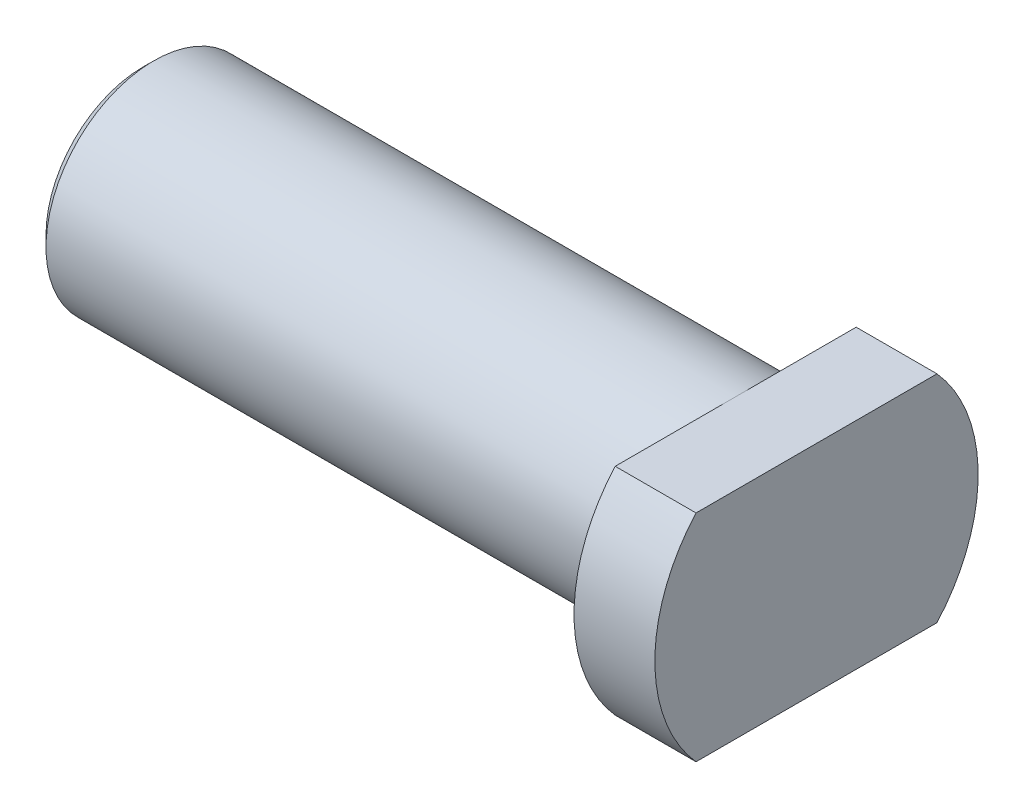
ISO-10303-21;
HEADER;
FILE_DESCRIPTION(('STEP AP214'),'2;1');
FILE_NAME('part.step','',(''),(''),'','','');
FILE_SCHEMA(('AUTOMOTIVE_DESIGN { 1 0 10303 214 1 1 1 1 }'));
ENDSEC;
DATA;
#1=APPLICATION_CONTEXT('core data for automotive mechanical design processes');
#2=APPLICATION_PROTOCOL_DEFINITION('international standard','automotive_design',2000,#1);
#3=PRODUCT_CONTEXT('',#1,'mechanical');
#4=PRODUCT('Part','Part','',(#3));
#5=PRODUCT_RELATED_PRODUCT_CATEGORY('part','',(#4));
#6=PRODUCT_DEFINITION_FORMATION('','',#4);
#7=PRODUCT_DEFINITION_CONTEXT('part definition',#1,'design');
#8=PRODUCT_DEFINITION('design','',#6,#7);
#9=PRODUCT_DEFINITION_SHAPE('','',#8);
#10=(LENGTH_UNIT() NAMED_UNIT(*) SI_UNIT(.MILLI.,.METRE.));
#11=(NAMED_UNIT(*) PLANE_ANGLE_UNIT() SI_UNIT($,.RADIAN.));
#12=(NAMED_UNIT(*) SI_UNIT($,.STERADIAN.) SOLID_ANGLE_UNIT());
#13=UNCERTAINTY_MEASURE_WITH_UNIT(LENGTH_MEASURE(1.E-05),#10,'distance_accuracy_value','');
#14=(GEOMETRIC_REPRESENTATION_CONTEXT(3) GLOBAL_UNCERTAINTY_ASSIGNED_CONTEXT((#13)) GLOBAL_UNIT_ASSIGNED_CONTEXT((#10,
#11,#12)) REPRESENTATION_CONTEXT('',''));
#15=CARTESIAN_POINT('',(0.,0.,0.));
#16=DIRECTION('',(0.,0.,1.));
#17=DIRECTION('',(1.,0.,0.));
#18=AXIS2_PLACEMENT_3D('',#15,#16,#17);
#19=CARTESIAN_POINT('',(-11.625,0.,0.));
#20=DIRECTION('',(1.,0.,0.));
#21=DIRECTION('',(0.,0.,-1.));
#22=AXIS2_PLACEMENT_3D('',#19,#20,#21);
#23=CYLINDRICAL_SURFACE('',#22,3.);
#24=CARTESIAN_POINT('',(0.,0.,0.));
#25=DIRECTION('',(1.,0.,0.));
#26=DIRECTION('',(0.,0.,-1.));
#27=AXIS2_PLACEMENT_3D('',#24,#25,#26);
#28=CIRCLE('',#27,3.);
#29=CARTESIAN_POINT('',(0.,-1.99999999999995,-2.23606797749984));
#30=VERTEX_POINT('',#29);
#31=CARTESIAN_POINT('',(0.,1.99999999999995,-2.23606797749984));
#32=VERTEX_POINT('',#31);
#33=EDGE_CURVE('E100',#30,#32,#28,.T.);
#34=ORIENTED_EDGE('',*,*,#33,.T.);
#35=DIRECTION('',(1.,0.,0.));
#36=VECTOR('',#35,1.);
#37=CARTESIAN_POINT('',(-11.625,1.9999999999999,-2.23606797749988));
#38=LINE('',#37,#36);
#39=CARTESIAN_POINT('',(1.5,1.99999999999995,-2.23606797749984));
#40=VERTEX_POINT('',#39);
#41=EDGE_CURVE('E105',#32,#40,#38,.T.);
#42=ORIENTED_EDGE('',*,*,#41,.T.);
#43=CARTESIAN_POINT('',(1.5,0.,0.));
#44=DIRECTION('',(1.,0.,0.));
#45=DIRECTION('',(0.,0.,-1.));
#46=AXIS2_PLACEMENT_3D('',#43,#44,#45);
#47=CIRCLE('',#46,3.);
#48=CARTESIAN_POINT('',(1.5,-1.99999999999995,-2.23606797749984));
#49=VERTEX_POINT('',#48);
#50=EDGE_CURVE('E19',#49,#40,#47,.T.);
#51=ORIENTED_EDGE('',*,*,#50,.F.);
#52=DIRECTION('',(1.,0.,0.));
#53=VECTOR('',#52,1.);
#54=CARTESIAN_POINT('',(-11.625,-1.9999999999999,-2.23606797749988));
#55=LINE('',#54,#53);
#56=EDGE_CURVE('E56',#49,#30,#55,.F.);
#57=ORIENTED_EDGE('',*,*,#56,.T.);
#58=EDGE_LOOP('',(#34,#42,#51,#57));
#59=FACE_BOUND('',#58,.T.);
#60=ADVANCED_FACE('F16',(#59),#23,.T.);
#61=CARTESIAN_POINT('',(1.5,0.,0.));
#62=DIRECTION('',(1.,0.,0.));
#63=DIRECTION('',(0.,0.,-1.));
#64=AXIS2_PLACEMENT_3D('',#61,#62,#63);
#65=PLANE('',#64);
#66=ORIENTED_EDGE('',*,*,#50,.T.);
#67=DIRECTION('',(0.,0.,-1.));
#68=VECTOR('',#67,1.);
#69=CARTESIAN_POINT('',(1.5,2.,2.2360679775));
#70=LINE('',#69,#68);
#71=CARTESIAN_POINT('',(1.5,1.99999999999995,2.23606797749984));
#72=VERTEX_POINT('',#71);
#73=EDGE_CURVE('E99',#40,#72,#70,.F.);
#74=ORIENTED_EDGE('',*,*,#73,.T.);
#75=CARTESIAN_POINT('',(1.5,0.,0.));
#76=DIRECTION('',(1.,0.,0.));
#77=DIRECTION('',(0.,0.,-1.));
#78=AXIS2_PLACEMENT_3D('',#75,#76,#77);
#79=CIRCLE('',#78,3.);
#80=CARTESIAN_POINT('',(1.5,-2.,2.23606797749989));
#81=VERTEX_POINT('',#80);
#82=EDGE_CURVE('E95',#81,#72,#79,.F.);
#83=ORIENTED_EDGE('',*,*,#82,.F.);
#84=DIRECTION('',(0.,0.,1.));
#85=VECTOR('',#84,1.);
#86=CARTESIAN_POINT('',(1.5,-2.,-2.2360679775));
#87=LINE('',#86,#85);
#88=EDGE_CURVE('E83',#81,#49,#87,.F.);
#89=ORIENTED_EDGE('',*,*,#88,.T.);
#90=EDGE_LOOP('',(#66,#74,#83,#89));
#91=FACE_BOUND('',#90,.T.);
#92=ADVANCED_FACE('F116',(#91),#65,.T.);
#93=CARTESIAN_POINT('',(-11.,0.,0.));
#94=DIRECTION('',(1.,0.,0.));
#95=DIRECTION('',(0.,0.,-1.));
#96=AXIS2_PLACEMENT_3D('',#93,#94,#95);
#97=PLANE('',#96);
#98=CARTESIAN_POINT('',(-11.0000000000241,0.,0.));
#99=DIRECTION('',(1.,0.,0.));
#100=DIRECTION('',(0.,0.,-1.));
#101=AXIS2_PLACEMENT_3D('',#98,#99,#100);
#102=CIRCLE('',#101,1.80000000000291);
#103=CARTESIAN_POINT('',(-11.0000000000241,0.,-1.80000000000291));
#104=VERTEX_POINT('',#103);
#105=EDGE_CURVE('E102',#104,#104,#102,.T.);
#106=ORIENTED_EDGE('',*,*,#105,.F.);
#107=EDGE_LOOP('',(#106));
#108=FACE_BOUND('',#107,.T.);
#109=ADVANCED_FACE('F123',(#108),#97,.F.);
#110=CARTESIAN_POINT('',(0.,0.,0.));
#111=DIRECTION('',(1.,0.,0.));
#112=DIRECTION('',(0.,0.,-1.));
#113=AXIS2_PLACEMENT_3D('',#110,#111,#112);
#114=PLANE('',#113);
#115=DIRECTION('',(0.,0.,1.));
#116=VECTOR('',#115,1.);
#117=CARTESIAN_POINT('',(0.,-2.,-2.2360679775));
#118=LINE('',#117,#116);
#119=CARTESIAN_POINT('',(0.,-2.,0.));
#120=VERTEX_POINT('',#119);
#121=EDGE_CURVE('E34',#30,#120,#118,.T.);
#122=ORIENTED_EDGE('',*,*,#121,.T.);
#123=CARTESIAN_POINT('',(0.,0.,0.));
#124=DIRECTION('',(1.,0.,0.));
#125=DIRECTION('',(0.,0.,-1.));
#126=AXIS2_PLACEMENT_3D('',#123,#124,#125);
#127=CIRCLE('',#126,2.);
#128=CARTESIAN_POINT('',(0.,2.,0.));
#129=VERTEX_POINT('',#128);
#130=EDGE_CURVE('E91',#129,#120,#127,.F.);
#131=ORIENTED_EDGE('',*,*,#130,.F.);
#132=DIRECTION('',(0.,0.,-1.));
#133=VECTOR('',#132,1.);
#134=CARTESIAN_POINT('',(0.,2.,2.2360679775));
#135=LINE('',#134,#133);
#136=EDGE_CURVE('E96',#129,#32,#135,.T.);
#137=ORIENTED_EDGE('',*,*,#136,.T.);
#138=ORIENTED_EDGE('',*,*,#33,.F.);
#139=EDGE_LOOP('',(#122,#131,#137,#138));
#140=FACE_BOUND('',#139,.T.);
#141=ADVANCED_FACE('F144',(#140),#114,.F.);
#142=CARTESIAN_POINT('',(1.5,2.,2.2360679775));
#143=DIRECTION('',(0.,-1.,0.));
#144=DIRECTION('',(0.,0.,-1.));
#145=AXIS2_PLACEMENT_3D('',#142,#143,#144);
#146=PLANE('',#145);
#147=ORIENTED_EDGE('',*,*,#73,.F.);
#148=ORIENTED_EDGE('',*,*,#41,.F.);
#149=ORIENTED_EDGE('',*,*,#136,.F.);
#150=DIRECTION('',(0.,0.,-1.));
#151=VECTOR('',#150,1.);
#152=CARTESIAN_POINT('',(0.,2.,0.));
#153=LINE('',#152,#151);
#154=CARTESIAN_POINT('',(0.,1.99999999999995,2.23606797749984));
#155=VERTEX_POINT('',#154);
#156=EDGE_CURVE('E64',#129,#155,#153,.F.);
#157=ORIENTED_EDGE('',*,*,#156,.T.);
#158=DIRECTION('',(1.,0.,0.));
#159=VECTOR('',#158,1.);
#160=CARTESIAN_POINT('',(-11.625,1.9999999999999,2.23606797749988));
#161=LINE('',#160,#159);
#162=EDGE_CURVE('E75',#72,#155,#161,.F.);
#163=ORIENTED_EDGE('',*,*,#162,.F.);
#164=EDGE_LOOP('',(#147,#148,#149,#157,#163));
#165=FACE_BOUND('',#164,.T.);
#166=ADVANCED_FACE('F117',(#165),#146,.F.);
#167=CARTESIAN_POINT('',(-11.625,0.,0.));
#168=DIRECTION('',(1.,0.,0.));
#169=DIRECTION('',(0.,0.,-1.));
#170=AXIS2_PLACEMENT_3D('',#167,#168,#169);
#171=CYLINDRICAL_SURFACE('',#170,3.);
#172=ORIENTED_EDGE('',*,*,#82,.T.);
#173=ORIENTED_EDGE('',*,*,#162,.T.);
#174=CARTESIAN_POINT('',(0.,0.,0.));
#175=DIRECTION('',(1.,0.,0.));
#176=DIRECTION('',(0.,0.,-1.));
#177=AXIS2_PLACEMENT_3D('',#174,#175,#176);
#178=CIRCLE('',#177,3.);
#179=CARTESIAN_POINT('',(0.,-2.,2.23606797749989));
#180=VERTEX_POINT('',#179);
#181=EDGE_CURVE('E70',#155,#180,#178,.T.);
#182=ORIENTED_EDGE('',*,*,#181,.T.);
#183=DIRECTION('',(1.,0.,0.));
#184=VECTOR('',#183,1.);
#185=CARTESIAN_POINT('',(1.5,-2.,2.2360679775));
#186=LINE('',#185,#184);
#187=EDGE_CURVE('E74',#180,#81,#186,.T.);
#188=ORIENTED_EDGE('',*,*,#187,.T.);
#189=EDGE_LOOP('',(#172,#173,#182,#188));
#190=FACE_BOUND('',#189,.T.);
#191=ADVANCED_FACE('F73',(#190),#171,.T.);
#192=CARTESIAN_POINT('',(1.5,-2.,-2.2360679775));
#193=DIRECTION('',(0.,1.,0.));
#194=DIRECTION('',(0.,0.,1.));
#195=AXIS2_PLACEMENT_3D('',#192,#193,#194);
#196=PLANE('',#195);
#197=ORIENTED_EDGE('',*,*,#88,.F.);
#198=ORIENTED_EDGE('',*,*,#187,.F.);
#199=DIRECTION('',(0.,0.,-1.));
#200=VECTOR('',#199,1.);
#201=CARTESIAN_POINT('',(0.,-2.,0.));
#202=LINE('',#201,#200);
#203=EDGE_CURVE('E78',#180,#120,#202,.T.);
#204=ORIENTED_EDGE('',*,*,#203,.T.);
#205=ORIENTED_EDGE('',*,*,#121,.F.);
#206=ORIENTED_EDGE('',*,*,#56,.F.);
#207=EDGE_LOOP('',(#197,#198,#204,#205,#206));
#208=FACE_BOUND('',#207,.T.);
#209=ADVANCED_FACE('F80',(#208),#196,.F.);
#210=CARTESIAN_POINT('',(-10.8000000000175,0.,0.));
#211=DIRECTION('',(1.,0.,0.));
#212=DIRECTION('',(0.,0.,-1.));
#213=AXIS2_PLACEMENT_3D('',#210,#211,#212);
#214=CONICAL_SURFACE('',#213,1.99999999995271,0.78539816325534);
#215=CARTESIAN_POINT('',(-10.8,0.,0.));
#216=DIRECTION('',(1.,0.,0.));
#217=DIRECTION('',(0.,0.,-1.));
#218=AXIS2_PLACEMENT_3D('',#215,#216,#217);
#219=CIRCLE('',#218,2.);
#220=CARTESIAN_POINT('',(-10.8,0.,-2.));
#221=VERTEX_POINT('',#220);
#222=EDGE_CURVE('E25',#221,#221,#219,.T.);
#223=ORIENTED_EDGE('',*,*,#222,.F.);
#224=EDGE_LOOP('',(#223));
#225=FACE_BOUND('',#224,.T.);
#226=ORIENTED_EDGE('',*,*,#105,.T.);
#227=EDGE_LOOP('',(#226));
#228=FACE_BOUND('',#227,.T.);
#229=ADVANCED_FACE('F131',(#225,#228),#214,.T.);
#230=CARTESIAN_POINT('',(0.,0.,0.));
#231=DIRECTION('',(1.,0.,0.));
#232=DIRECTION('',(0.,0.,-1.));
#233=AXIS2_PLACEMENT_3D('',#230,#231,#232);
#234=PLANE('',#233);
#235=ORIENTED_EDGE('',*,*,#203,.F.);
#236=ORIENTED_EDGE('',*,*,#181,.F.);
#237=ORIENTED_EDGE('',*,*,#156,.F.);
#238=CARTESIAN_POINT('',(0.,0.,0.));
#239=DIRECTION('',(1.,0.,0.));
#240=DIRECTION('',(0.,0.,-1.));
#241=AXIS2_PLACEMENT_3D('',#238,#239,#240);
#242=CIRCLE('',#241,2.);
#243=EDGE_CURVE('E11',#120,#129,#242,.F.);
#244=ORIENTED_EDGE('',*,*,#243,.F.);
#245=EDGE_LOOP('',(#235,#236,#237,#244));
#246=FACE_BOUND('',#245,.T.);
#247=ADVANCED_FACE('F86',(#246),#234,.F.);
#248=CARTESIAN_POINT('',(-11.625,0.,0.));
#249=DIRECTION('',(1.,0.,0.));
#250=DIRECTION('',(0.,0.,-1.));
#251=AXIS2_PLACEMENT_3D('',#248,#249,#250);
#252=CYLINDRICAL_SURFACE('',#251,2.);
#253=ORIENTED_EDGE('',*,*,#222,.T.);
#254=EDGE_LOOP('',(#253));
#255=FACE_BOUND('',#254,.T.);
#256=ORIENTED_EDGE('',*,*,#243,.T.);
#257=ORIENTED_EDGE('',*,*,#130,.T.);
#258=EDGE_LOOP('',(#256,#257));
#259=FACE_BOUND('',#258,.T.);
#260=ADVANCED_FACE('F124',(#255,#259),#252,.T.);
#261=CLOSED_SHELL('',(#60,#92,#109,#141,#166,#191,#209,#229,#247,#260));
#262=MANIFOLD_SOLID_BREP('B1',#261);
#263=ADVANCED_BREP_SHAPE_REPRESENTATION('',(#18,#262),#14);
#264=SHAPE_DEFINITION_REPRESENTATION(#9,#263);
ENDSEC;
END-ISO-10303-21;
